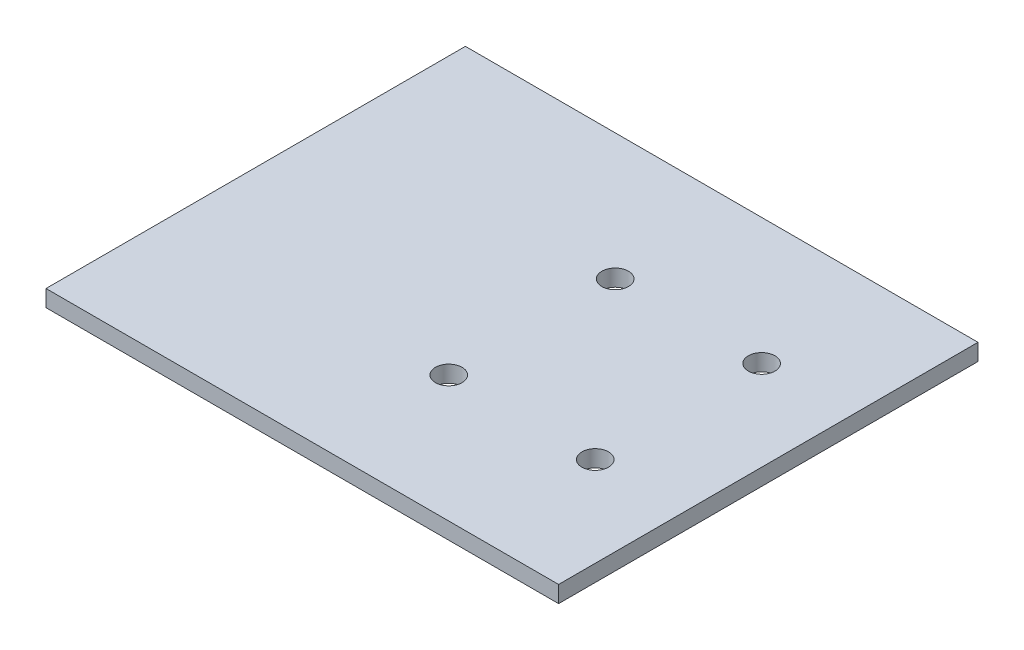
ISO-10303-21;
HEADER;
FILE_DESCRIPTION(('STEP AP214'),'2;1');
FILE_NAME('part.step','',(''),(''),'','','');
FILE_SCHEMA(('AUTOMOTIVE_DESIGN { 1 0 10303 214 1 1 1 1 }'));
ENDSEC;
DATA;
#1=APPLICATION_CONTEXT('core data for automotive mechanical design processes');
#2=APPLICATION_PROTOCOL_DEFINITION('international standard','automotive_design',2000,#1);
#3=PRODUCT_CONTEXT('',#1,'mechanical');
#4=PRODUCT('Part','Part','',(#3));
#5=PRODUCT_RELATED_PRODUCT_CATEGORY('part','',(#4));
#6=PRODUCT_DEFINITION_FORMATION('','',#4);
#7=PRODUCT_DEFINITION_CONTEXT('part definition',#1,'design');
#8=PRODUCT_DEFINITION('design','',#6,#7);
#9=PRODUCT_DEFINITION_SHAPE('','',#8);
#10=(LENGTH_UNIT() NAMED_UNIT(*) SI_UNIT(.MILLI.,.METRE.));
#11=(NAMED_UNIT(*) PLANE_ANGLE_UNIT() SI_UNIT($,.RADIAN.));
#12=(NAMED_UNIT(*) SI_UNIT($,.STERADIAN.) SOLID_ANGLE_UNIT());
#13=UNCERTAINTY_MEASURE_WITH_UNIT(LENGTH_MEASURE(1.E-05),#10,'distance_accuracy_value','');
#14=(GEOMETRIC_REPRESENTATION_CONTEXT(3) GLOBAL_UNCERTAINTY_ASSIGNED_CONTEXT((#13)) GLOBAL_UNIT_ASSIGNED_CONTEXT((#10,
#11,#12)) REPRESENTATION_CONTEXT('',''));
#15=CARTESIAN_POINT('',(0.,0.,0.));
#16=DIRECTION('',(0.,0.,1.));
#17=DIRECTION('',(1.,0.,0.));
#18=AXIS2_PLACEMENT_3D('',#15,#16,#17);
#19=CARTESIAN_POINT('',(0.,2.5,0.));
#20=DIRECTION('',(0.,1.,0.));
#21=DIRECTION('',(0.,0.,1.));
#22=AXIS2_PLACEMENT_3D('',#19,#20,#21);
#23=PLANE('',#22);
#24=CARTESIAN_POINT('',(3.00000000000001,2.5,-12.4999999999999));
#25=DIRECTION('',(0.,1.,0.));
#26=DIRECTION('',(0.,0.,1.));
#27=AXIS2_PLACEMENT_3D('',#24,#25,#26);
#28=CIRCLE('',#27,2.);
#29=CARTESIAN_POINT('',(3.00000000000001,2.5,-10.4999999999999));
#30=VERTEX_POINT('',#29);
#31=EDGE_CURVE('E122',#30,#30,#28,.T.);
#32=ORIENTED_EDGE('',*,*,#31,.F.);
#33=EDGE_LOOP('',(#32));
#34=FACE_BOUND('',#33,.T.);
#35=CARTESIAN_POINT('',(25.,2.5,-12.5));
#36=DIRECTION('',(0.,1.,0.));
#37=DIRECTION('',(0.,0.,1.));
#38=AXIS2_PLACEMENT_3D('',#35,#36,#37);
#39=CIRCLE('',#38,2.);
#40=CARTESIAN_POINT('',(25.,2.5,-10.5));
#41=VERTEX_POINT('',#40);
#42=EDGE_CURVE('E101',#41,#41,#39,.T.);
#43=ORIENTED_EDGE('',*,*,#42,.F.);
#44=EDGE_LOOP('',(#43));
#45=FACE_BOUND('',#44,.T.);
#46=DIRECTION('',(0.,0.,-1.));
#47=VECTOR('',#46,1.);
#48=CARTESIAN_POINT('',(38.5,2.5,-31.5));
#49=LINE('',#48,#47);
#50=CARTESIAN_POINT('',(38.5,2.5,31.5));
#51=VERTEX_POINT('',#50);
#52=CARTESIAN_POINT('',(38.5,2.5,-31.5));
#53=VERTEX_POINT('',#52);
#54=EDGE_CURVE('E86',#51,#53,#49,.T.);
#55=ORIENTED_EDGE('',*,*,#54,.T.);
#56=DIRECTION('',(-1.,0.,0.));
#57=VECTOR('',#56,1.);
#58=CARTESIAN_POINT('',(-38.5,2.5,-31.5));
#59=LINE('',#58,#57);
#60=CARTESIAN_POINT('',(-38.5,2.5,-31.5));
#61=VERTEX_POINT('',#60);
#62=EDGE_CURVE('E81',#53,#61,#59,.T.);
#63=ORIENTED_EDGE('',*,*,#62,.T.);
#64=DIRECTION('',(0.,0.,1.));
#65=VECTOR('',#64,1.);
#66=CARTESIAN_POINT('',(-38.5,2.5,-31.5));
#67=LINE('',#66,#65);
#68=CARTESIAN_POINT('',(-38.5,2.5,31.5));
#69=VERTEX_POINT('',#68);
#70=EDGE_CURVE('E84',#61,#69,#67,.T.);
#71=ORIENTED_EDGE('',*,*,#70,.T.);
#72=DIRECTION('',(1.,0.,0.));
#73=VECTOR('',#72,1.);
#74=CARTESIAN_POINT('',(-38.5,2.5,31.5));
#75=LINE('',#74,#73);
#76=EDGE_CURVE('E51',#69,#51,#75,.T.);
#77=ORIENTED_EDGE('',*,*,#76,.T.);
#78=EDGE_LOOP('',(#55,#63,#71,#77));
#79=FACE_BOUND('',#78,.T.);
#80=CARTESIAN_POINT('',(25.,2.5,12.5));
#81=DIRECTION('',(0.,1.,0.));
#82=DIRECTION('',(0.,0.,1.));
#83=AXIS2_PLACEMENT_3D('',#80,#81,#82);
#84=CIRCLE('',#83,2.);
#85=CARTESIAN_POINT('',(25.,2.5,14.5));
#86=VERTEX_POINT('',#85);
#87=EDGE_CURVE('E116',#86,#86,#84,.T.);
#88=ORIENTED_EDGE('',*,*,#87,.F.);
#89=EDGE_LOOP('',(#88));
#90=FACE_BOUND('',#89,.T.);
#91=CARTESIAN_POINT('',(3.00000000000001,2.5,12.5000000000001));
#92=DIRECTION('',(0.,1.,0.));
#93=DIRECTION('',(0.,0.,1.));
#94=AXIS2_PLACEMENT_3D('',#91,#92,#93);
#95=CIRCLE('',#94,2.);
#96=CARTESIAN_POINT('',(3.00000000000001,2.5,14.5000000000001));
#97=VERTEX_POINT('',#96);
#98=EDGE_CURVE('E128',#97,#97,#95,.T.);
#99=ORIENTED_EDGE('',*,*,#98,.F.);
#100=EDGE_LOOP('',(#99));
#101=FACE_BOUND('',#100,.T.);
#102=ADVANCED_FACE('F34',(#34,#45,#79,#90,#101),#23,.T.);
#103=CARTESIAN_POINT('',(0.,0.,0.));
#104=DIRECTION('',(0.,1.,0.));
#105=DIRECTION('',(0.,0.,1.));
#106=AXIS2_PLACEMENT_3D('',#103,#104,#105);
#107=PLANE('',#106);
#108=CARTESIAN_POINT('',(3.00000000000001,0.,-12.4999999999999));
#109=DIRECTION('',(0.,1.,0.));
#110=DIRECTION('',(0.,0.,1.));
#111=AXIS2_PLACEMENT_3D('',#108,#109,#110);
#112=CIRCLE('',#111,2.);
#113=CARTESIAN_POINT('',(3.00000000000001,0.,-10.4999999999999));
#114=VERTEX_POINT('',#113);
#115=EDGE_CURVE('E125',#114,#114,#112,.T.);
#116=ORIENTED_EDGE('',*,*,#115,.T.);
#117=EDGE_LOOP('',(#116));
#118=FACE_BOUND('',#117,.T.);
#119=CARTESIAN_POINT('',(25.,0.,-12.5));
#120=DIRECTION('',(0.,1.,0.));
#121=DIRECTION('',(0.,0.,1.));
#122=AXIS2_PLACEMENT_3D('',#119,#120,#121);
#123=CIRCLE('',#122,2.);
#124=CARTESIAN_POINT('',(25.,0.,-10.5));
#125=VERTEX_POINT('',#124);
#126=EDGE_CURVE('E113',#125,#125,#123,.T.);
#127=ORIENTED_EDGE('',*,*,#126,.T.);
#128=EDGE_LOOP('',(#127));
#129=FACE_BOUND('',#128,.T.);
#130=DIRECTION('',(0.,0.,-1.));
#131=VECTOR('',#130,1.);
#132=CARTESIAN_POINT('',(38.5,0.,-31.5));
#133=LINE('',#132,#131);
#134=CARTESIAN_POINT('',(38.5,0.,31.5));
#135=VERTEX_POINT('',#134);
#136=CARTESIAN_POINT('',(38.5,0.,-31.5));
#137=VERTEX_POINT('',#136);
#138=EDGE_CURVE('E98',#135,#137,#133,.T.);
#139=ORIENTED_EDGE('',*,*,#138,.F.);
#140=DIRECTION('',(1.,0.,0.));
#141=VECTOR('',#140,1.);
#142=CARTESIAN_POINT('',(-38.5,0.,31.5));
#143=LINE('',#142,#141);
#144=CARTESIAN_POINT('',(-38.5,0.,31.5));
#145=VERTEX_POINT('',#144);
#146=EDGE_CURVE('E74',#145,#135,#143,.T.);
#147=ORIENTED_EDGE('',*,*,#146,.F.);
#148=DIRECTION('',(0.,0.,1.));
#149=VECTOR('',#148,1.);
#150=CARTESIAN_POINT('',(-38.5,0.,-31.5));
#151=LINE('',#150,#149);
#152=CARTESIAN_POINT('',(-38.5,0.,-31.5));
#153=VERTEX_POINT('',#152);
#154=EDGE_CURVE('E68',#153,#145,#151,.T.);
#155=ORIENTED_EDGE('',*,*,#154,.F.);
#156=DIRECTION('',(-1.,0.,0.));
#157=VECTOR('',#156,1.);
#158=CARTESIAN_POINT('',(-38.5,0.,-31.5));
#159=LINE('',#158,#157);
#160=EDGE_CURVE('E90',#137,#153,#159,.T.);
#161=ORIENTED_EDGE('',*,*,#160,.F.);
#162=EDGE_LOOP('',(#139,#147,#155,#161));
#163=FACE_BOUND('',#162,.T.);
#164=CARTESIAN_POINT('',(25.,0.,12.5));
#165=DIRECTION('',(0.,1.,0.));
#166=DIRECTION('',(0.,0.,1.));
#167=AXIS2_PLACEMENT_3D('',#164,#165,#166);
#168=CIRCLE('',#167,2.);
#169=CARTESIAN_POINT('',(25.,0.,14.5));
#170=VERTEX_POINT('',#169);
#171=EDGE_CURVE('E119',#170,#170,#168,.T.);
#172=ORIENTED_EDGE('',*,*,#171,.T.);
#173=EDGE_LOOP('',(#172));
#174=FACE_BOUND('',#173,.T.);
#175=CARTESIAN_POINT('',(3.00000000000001,0.,12.5000000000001));
#176=DIRECTION('',(0.,1.,0.));
#177=DIRECTION('',(0.,0.,1.));
#178=AXIS2_PLACEMENT_3D('',#175,#176,#177);
#179=CIRCLE('',#178,2.);
#180=CARTESIAN_POINT('',(3.00000000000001,0.,14.5000000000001));
#181=VERTEX_POINT('',#180);
#182=EDGE_CURVE('E131',#181,#181,#179,.T.);
#183=ORIENTED_EDGE('',*,*,#182,.T.);
#184=EDGE_LOOP('',(#183));
#185=FACE_BOUND('',#184,.T.);
#186=ADVANCED_FACE('F109',(#118,#129,#163,#174,#185),#107,.F.);
#187=CARTESIAN_POINT('',(38.5,2.5,-31.5));
#188=DIRECTION('',(-1.,0.,0.));
#189=DIRECTION('',(0.,0.,1.));
#190=AXIS2_PLACEMENT_3D('',#187,#188,#189);
#191=PLANE('',#190);
#192=ORIENTED_EDGE('',*,*,#138,.T.);
#193=DIRECTION('',(0.,-1.,0.));
#194=VECTOR('',#193,1.);
#195=CARTESIAN_POINT('',(38.5,2.5,-31.5));
#196=LINE('',#195,#194);
#197=EDGE_CURVE('E11',#53,#137,#196,.T.);
#198=ORIENTED_EDGE('',*,*,#197,.F.);
#199=ORIENTED_EDGE('',*,*,#54,.F.);
#200=DIRECTION('',(0.,-1.,0.));
#201=VECTOR('',#200,1.);
#202=CARTESIAN_POINT('',(38.5,2.5,31.5));
#203=LINE('',#202,#201);
#204=EDGE_CURVE('E94',#51,#135,#203,.T.);
#205=ORIENTED_EDGE('',*,*,#204,.T.);
#206=EDGE_LOOP('',(#192,#198,#199,#205));
#207=FACE_BOUND('',#206,.T.);
#208=ADVANCED_FACE('F36',(#207),#191,.F.);
#209=CARTESIAN_POINT('',(-38.5,2.5,-31.5));
#210=DIRECTION('',(0.,0.,1.));
#211=DIRECTION('',(1.,0.,0.));
#212=AXIS2_PLACEMENT_3D('',#209,#210,#211);
#213=PLANE('',#212);
#214=ORIENTED_EDGE('',*,*,#160,.T.);
#215=DIRECTION('',(0.,-1.,0.));
#216=VECTOR('',#215,1.);
#217=CARTESIAN_POINT('',(-38.5,2.5,-31.5));
#218=LINE('',#217,#216);
#219=EDGE_CURVE('E43',#61,#153,#218,.T.);
#220=ORIENTED_EDGE('',*,*,#219,.F.);
#221=ORIENTED_EDGE('',*,*,#62,.F.);
#222=ORIENTED_EDGE('',*,*,#197,.T.);
#223=EDGE_LOOP('',(#214,#220,#221,#222));
#224=FACE_BOUND('',#223,.T.);
#225=ADVANCED_FACE('F89',(#224),#213,.F.);
#226=CARTESIAN_POINT('',(-38.5,2.5,-31.5));
#227=DIRECTION('',(1.,0.,0.));
#228=DIRECTION('',(0.,0.,-1.));
#229=AXIS2_PLACEMENT_3D('',#226,#227,#228);
#230=PLANE('',#229);
#231=ORIENTED_EDGE('',*,*,#154,.T.);
#232=DIRECTION('',(0.,-1.,0.));
#233=VECTOR('',#232,1.);
#234=CARTESIAN_POINT('',(-38.5,2.5,31.5));
#235=LINE('',#234,#233);
#236=EDGE_CURVE('E91',#69,#145,#235,.T.);
#237=ORIENTED_EDGE('',*,*,#236,.F.);
#238=ORIENTED_EDGE('',*,*,#70,.F.);
#239=ORIENTED_EDGE('',*,*,#219,.T.);
#240=EDGE_LOOP('',(#231,#237,#238,#239));
#241=FACE_BOUND('',#240,.T.);
#242=ADVANCED_FACE('F92',(#241),#230,.F.);
#243=CARTESIAN_POINT('',(-38.5,2.5,31.5));
#244=DIRECTION('',(0.,0.,-1.));
#245=DIRECTION('',(-1.,0.,0.));
#246=AXIS2_PLACEMENT_3D('',#243,#244,#245);
#247=PLANE('',#246);
#248=ORIENTED_EDGE('',*,*,#146,.T.);
#249=ORIENTED_EDGE('',*,*,#204,.F.);
#250=ORIENTED_EDGE('',*,*,#76,.F.);
#251=ORIENTED_EDGE('',*,*,#236,.T.);
#252=EDGE_LOOP('',(#248,#249,#250,#251));
#253=FACE_BOUND('',#252,.T.);
#254=ADVANCED_FACE('F106',(#253),#247,.F.);
#255=CARTESIAN_POINT('',(25.,2.5,-12.5));
#256=DIRECTION('',(0.,-1.,0.));
#257=DIRECTION('',(0.,0.,-1.));
#258=AXIS2_PLACEMENT_3D('',#255,#256,#257);
#259=CYLINDRICAL_SURFACE('',#258,2.);
#260=ORIENTED_EDGE('',*,*,#42,.T.);
#261=EDGE_LOOP('',(#260));
#262=FACE_BOUND('',#261,.T.);
#263=ORIENTED_EDGE('',*,*,#126,.F.);
#264=EDGE_LOOP('',(#263));
#265=FACE_BOUND('',#264,.T.);
#266=ADVANCED_FACE('F151',(#262,#265),#259,.F.);
#267=CARTESIAN_POINT('',(25.,2.5,12.5));
#268=DIRECTION('',(0.,-1.,0.));
#269=DIRECTION('',(0.,0.,-1.));
#270=AXIS2_PLACEMENT_3D('',#267,#268,#269);
#271=CYLINDRICAL_SURFACE('',#270,2.);
#272=ORIENTED_EDGE('',*,*,#87,.T.);
#273=EDGE_LOOP('',(#272));
#274=FACE_BOUND('',#273,.T.);
#275=ORIENTED_EDGE('',*,*,#171,.F.);
#276=EDGE_LOOP('',(#275));
#277=FACE_BOUND('',#276,.T.);
#278=ADVANCED_FACE('F204',(#274,#277),#271,.F.);
#279=CARTESIAN_POINT('',(3.00000000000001,2.5,-12.4999999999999));
#280=DIRECTION('',(0.,-1.,0.));
#281=DIRECTION('',(0.,0.,-1.));
#282=AXIS2_PLACEMENT_3D('',#279,#280,#281);
#283=CYLINDRICAL_SURFACE('',#282,2.);
#284=ORIENTED_EDGE('',*,*,#31,.T.);
#285=EDGE_LOOP('',(#284));
#286=FACE_BOUND('',#285,.T.);
#287=ORIENTED_EDGE('',*,*,#115,.F.);
#288=EDGE_LOOP('',(#287));
#289=FACE_BOUND('',#288,.T.);
#290=ADVANCED_FACE('F214',(#286,#289),#283,.F.);
#291=CARTESIAN_POINT('',(3.00000000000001,2.5,12.5000000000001));
#292=DIRECTION('',(0.,-1.,0.));
#293=DIRECTION('',(0.,0.,-1.));
#294=AXIS2_PLACEMENT_3D('',#291,#292,#293);
#295=CYLINDRICAL_SURFACE('',#294,2.);
#296=ORIENTED_EDGE('',*,*,#98,.T.);
#297=EDGE_LOOP('',(#296));
#298=FACE_BOUND('',#297,.T.);
#299=ORIENTED_EDGE('',*,*,#182,.F.);
#300=EDGE_LOOP('',(#299));
#301=FACE_BOUND('',#300,.T.);
#302=ADVANCED_FACE('F137',(#298,#301),#295,.F.);
#303=CLOSED_SHELL('',(#102,#186,#208,#225,#242,#254,#266,#278,#290,#302));
#304=MANIFOLD_SOLID_BREP('B2',#303);
#305=ADVANCED_BREP_SHAPE_REPRESENTATION('',(#18,#304),#14);
#306=SHAPE_DEFINITION_REPRESENTATION(#9,#305);
ENDSEC;
END-ISO-10303-21;
